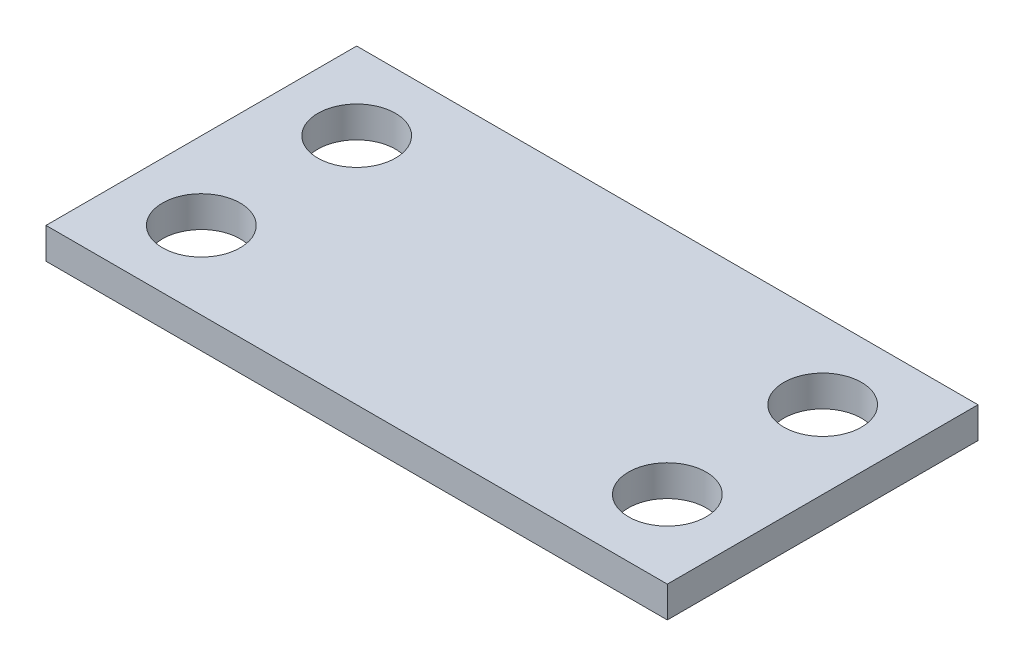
ISO-10303-21;
HEADER;
FILE_DESCRIPTION(('STEP AP214'),'2;1');
FILE_NAME('part.step','',(''),(''),'','','');
FILE_SCHEMA(('AUTOMOTIVE_DESIGN { 1 0 10303 214 1 1 1 1 }'));
ENDSEC;
DATA;
#1=APPLICATION_CONTEXT('core data for automotive mechanical design processes');
#2=APPLICATION_PROTOCOL_DEFINITION('international standard','automotive_design',2000,#1);
#3=PRODUCT_CONTEXT('',#1,'mechanical');
#4=PRODUCT('Part','Part','',(#3));
#5=PRODUCT_RELATED_PRODUCT_CATEGORY('part','',(#4));
#6=PRODUCT_DEFINITION_FORMATION('','',#4);
#7=PRODUCT_DEFINITION_CONTEXT('part definition',#1,'design');
#8=PRODUCT_DEFINITION('design','',#6,#7);
#9=PRODUCT_DEFINITION_SHAPE('','',#8);
#10=(LENGTH_UNIT() NAMED_UNIT(*) SI_UNIT(.MILLI.,.METRE.));
#11=(NAMED_UNIT(*) PLANE_ANGLE_UNIT() SI_UNIT($,.RADIAN.));
#12=(NAMED_UNIT(*) SI_UNIT($,.STERADIAN.) SOLID_ANGLE_UNIT());
#13=UNCERTAINTY_MEASURE_WITH_UNIT(LENGTH_MEASURE(1.E-05),#10,'distance_accuracy_value','');
#14=(GEOMETRIC_REPRESENTATION_CONTEXT(3) GLOBAL_UNCERTAINTY_ASSIGNED_CONTEXT((#13)) GLOBAL_UNIT_ASSIGNED_CONTEXT((#10,
#11,#12)) REPRESENTATION_CONTEXT('',''));
#15=CARTESIAN_POINT('',(0.,0.,0.));
#16=DIRECTION('',(0.,0.,1.));
#17=DIRECTION('',(1.,0.,0.));
#18=AXIS2_PLACEMENT_3D('',#15,#16,#17);
#19=CARTESIAN_POINT('',(40.,4.,-20.));
#20=DIRECTION('',(0.,0.,1.));
#21=DIRECTION('',(1.,0.,0.));
#22=AXIS2_PLACEMENT_3D('',#19,#20,#21);
#23=PLANE('',#22);
#24=DIRECTION('',(-1.,0.,0.));
#25=VECTOR('',#24,1.);
#26=CARTESIAN_POINT('',(40.,0.,-20.));
#27=LINE('',#26,#25);
#28=CARTESIAN_POINT('',(40.,0.,-20.));
#29=VERTEX_POINT('',#28);
#30=CARTESIAN_POINT('',(-40.,0.,-20.));
#31=VERTEX_POINT('',#30);
#32=EDGE_CURVE('E97',#29,#31,#27,.T.);
#33=ORIENTED_EDGE('',*,*,#32,.T.);
#34=DIRECTION('',(0.,-1.,0.));
#35=VECTOR('',#34,1.);
#36=CARTESIAN_POINT('',(-40.,4.,-20.));
#37=LINE('',#36,#35);
#38=CARTESIAN_POINT('',(-40.,4.,-20.));
#39=VERTEX_POINT('',#38);
#40=EDGE_CURVE('E11',#39,#31,#37,.T.);
#41=ORIENTED_EDGE('',*,*,#40,.F.);
#42=DIRECTION('',(-1.,0.,0.));
#43=VECTOR('',#42,1.);
#44=CARTESIAN_POINT('',(40.,4.,-20.));
#45=LINE('',#44,#43);
#46=CARTESIAN_POINT('',(40.,4.,-20.));
#47=VERTEX_POINT('',#46);
#48=EDGE_CURVE('E85',#47,#39,#45,.T.);
#49=ORIENTED_EDGE('',*,*,#48,.F.);
#50=DIRECTION('',(0.,-1.,0.));
#51=VECTOR('',#50,1.);
#52=CARTESIAN_POINT('',(40.,4.,-20.));
#53=LINE('',#52,#51);
#54=EDGE_CURVE('E93',#47,#29,#53,.T.);
#55=ORIENTED_EDGE('',*,*,#54,.T.);
#56=EDGE_LOOP('',(#33,#41,#49,#55));
#57=FACE_BOUND('',#56,.T.);
#58=ADVANCED_FACE('F34',(#57),#23,.F.);
#59=CARTESIAN_POINT('',(-40.,4.,-20.));
#60=DIRECTION('',(1.,0.,0.));
#61=DIRECTION('',(0.,0.,-1.));
#62=AXIS2_PLACEMENT_3D('',#59,#60,#61);
#63=PLANE('',#62);
#64=DIRECTION('',(0.,0.,1.));
#65=VECTOR('',#64,1.);
#66=CARTESIAN_POINT('',(-40.,0.,-20.));
#67=LINE('',#66,#65);
#68=CARTESIAN_POINT('',(-40.,0.,20.));
#69=VERTEX_POINT('',#68);
#70=EDGE_CURVE('E89',#31,#69,#67,.T.);
#71=ORIENTED_EDGE('',*,*,#70,.T.);
#72=DIRECTION('',(0.,-1.,0.));
#73=VECTOR('',#72,1.);
#74=CARTESIAN_POINT('',(-40.,4.,20.));
#75=LINE('',#74,#73);
#76=CARTESIAN_POINT('',(-40.,4.,20.));
#77=VERTEX_POINT('',#76);
#78=EDGE_CURVE('E42',#77,#69,#75,.T.);
#79=ORIENTED_EDGE('',*,*,#78,.F.);
#80=DIRECTION('',(0.,0.,1.));
#81=VECTOR('',#80,1.);
#82=CARTESIAN_POINT('',(-40.,4.,-20.));
#83=LINE('',#82,#81);
#84=EDGE_CURVE('E80',#39,#77,#83,.T.);
#85=ORIENTED_EDGE('',*,*,#84,.F.);
#86=ORIENTED_EDGE('',*,*,#40,.T.);
#87=EDGE_LOOP('',(#71,#79,#85,#86));
#88=FACE_BOUND('',#87,.T.);
#89=ADVANCED_FACE('F88',(#88),#63,.F.);
#90=CARTESIAN_POINT('',(-40.,4.,20.));
#91=DIRECTION('',(0.,0.,-1.));
#92=DIRECTION('',(-1.,0.,0.));
#93=AXIS2_PLACEMENT_3D('',#90,#91,#92);
#94=PLANE('',#93);
#95=DIRECTION('',(1.,0.,0.));
#96=VECTOR('',#95,1.);
#97=CARTESIAN_POINT('',(-40.,0.,20.));
#98=LINE('',#97,#96);
#99=CARTESIAN_POINT('',(40.,0.,20.));
#100=VERTEX_POINT('',#99);
#101=EDGE_CURVE('E67',#69,#100,#98,.T.);
#102=ORIENTED_EDGE('',*,*,#101,.T.);
#103=DIRECTION('',(0.,-1.,0.));
#104=VECTOR('',#103,1.);
#105=CARTESIAN_POINT('',(40.,4.,20.));
#106=LINE('',#105,#104);
#107=CARTESIAN_POINT('',(40.,4.,20.));
#108=VERTEX_POINT('',#107);
#109=EDGE_CURVE('E90',#108,#100,#106,.T.);
#110=ORIENTED_EDGE('',*,*,#109,.F.);
#111=DIRECTION('',(1.,0.,0.));
#112=VECTOR('',#111,1.);
#113=CARTESIAN_POINT('',(-40.,4.,20.));
#114=LINE('',#113,#112);
#115=EDGE_CURVE('E83',#77,#108,#114,.T.);
#116=ORIENTED_EDGE('',*,*,#115,.F.);
#117=ORIENTED_EDGE('',*,*,#78,.T.);
#118=EDGE_LOOP('',(#102,#110,#116,#117));
#119=FACE_BOUND('',#118,.T.);
#120=ADVANCED_FACE('F91',(#119),#94,.F.);
#121=CARTESIAN_POINT('',(40.,4.,20.));
#122=DIRECTION('',(-1.,0.,0.));
#123=DIRECTION('',(0.,0.,1.));
#124=AXIS2_PLACEMENT_3D('',#121,#122,#123);
#125=PLANE('',#124);
#126=DIRECTION('',(0.,0.,-1.));
#127=VECTOR('',#126,1.);
#128=CARTESIAN_POINT('',(40.,0.,20.));
#129=LINE('',#128,#127);
#130=EDGE_CURVE('E73',#100,#29,#129,.T.);
#131=ORIENTED_EDGE('',*,*,#130,.T.);
#132=ORIENTED_EDGE('',*,*,#54,.F.);
#133=DIRECTION('',(0.,0.,-1.));
#134=VECTOR('',#133,1.);
#135=CARTESIAN_POINT('',(40.,4.,20.));
#136=LINE('',#135,#134);
#137=EDGE_CURVE('E50',#108,#47,#136,.T.);
#138=ORIENTED_EDGE('',*,*,#137,.F.);
#139=ORIENTED_EDGE('',*,*,#109,.T.);
#140=EDGE_LOOP('',(#131,#132,#138,#139));
#141=FACE_BOUND('',#140,.T.);
#142=ADVANCED_FACE('F105',(#141),#125,.F.);
#143=CARTESIAN_POINT('',(0.,4.,0.));
#144=DIRECTION('',(0.,1.,0.));
#145=DIRECTION('',(0.,0.,1.));
#146=AXIS2_PLACEMENT_3D('',#143,#144,#145);
#147=PLANE('',#146);
#148=CARTESIAN_POINT('',(30.,4.,-10.));
#149=DIRECTION('',(0.,1.,0.));
#150=DIRECTION('',(0.,0.,1.));
#151=AXIS2_PLACEMENT_3D('',#148,#149,#150);
#152=CIRCLE('',#151,5.);
#153=CARTESIAN_POINT('',(30.,4.,-5.));
#154=VERTEX_POINT('',#153);
#155=EDGE_CURVE('E129',#154,#154,#152,.T.);
#156=ORIENTED_EDGE('',*,*,#155,.F.);
#157=EDGE_LOOP('',(#156));
#158=FACE_BOUND('',#157,.T.);
#159=CARTESIAN_POINT('',(30.,4.,10.));
#160=DIRECTION('',(0.,1.,0.));
#161=DIRECTION('',(0.,0.,1.));
#162=AXIS2_PLACEMENT_3D('',#159,#160,#161);
#163=CIRCLE('',#162,5.);
#164=CARTESIAN_POINT('',(30.,4.,15.));
#165=VERTEX_POINT('',#164);
#166=EDGE_CURVE('E123',#165,#165,#163,.T.);
#167=ORIENTED_EDGE('',*,*,#166,.F.);
#168=EDGE_LOOP('',(#167));
#169=FACE_BOUND('',#168,.T.);
#170=CARTESIAN_POINT('',(-30.,4.,10.));
#171=DIRECTION('',(0.,1.,0.));
#172=DIRECTION('',(0.,0.,1.));
#173=AXIS2_PLACEMENT_3D('',#170,#171,#172);
#174=CIRCLE('',#173,5.);
#175=CARTESIAN_POINT('',(-30.,4.,15.));
#176=VERTEX_POINT('',#175);
#177=EDGE_CURVE('E117',#176,#176,#174,.T.);
#178=ORIENTED_EDGE('',*,*,#177,.F.);
#179=EDGE_LOOP('',(#178));
#180=FACE_BOUND('',#179,.T.);
#181=CARTESIAN_POINT('',(-30.,4.,-10.));
#182=DIRECTION('',(0.,1.,0.));
#183=DIRECTION('',(0.,0.,1.));
#184=AXIS2_PLACEMENT_3D('',#181,#182,#183);
#185=CIRCLE('',#184,5.);
#186=CARTESIAN_POINT('',(-30.,4.,-5.));
#187=VERTEX_POINT('',#186);
#188=EDGE_CURVE('E111',#187,#187,#185,.T.);
#189=ORIENTED_EDGE('',*,*,#188,.F.);
#190=EDGE_LOOP('',(#189));
#191=FACE_BOUND('',#190,.T.);
#192=ORIENTED_EDGE('',*,*,#48,.T.);
#193=ORIENTED_EDGE('',*,*,#84,.T.);
#194=ORIENTED_EDGE('',*,*,#115,.T.);
#195=ORIENTED_EDGE('',*,*,#137,.T.);
#196=EDGE_LOOP('',(#192,#193,#194,#195));
#197=FACE_BOUND('',#196,.T.);
#198=ADVANCED_FACE('F81',(#158,#169,#180,#191,#197),#147,.T.);
#199=CARTESIAN_POINT('',(0.,0.,0.));
#200=DIRECTION('',(0.,1.,0.));
#201=DIRECTION('',(0.,0.,1.));
#202=AXIS2_PLACEMENT_3D('',#199,#200,#201);
#203=PLANE('',#202);
#204=CARTESIAN_POINT('',(30.,0.,-10.));
#205=DIRECTION('',(0.,1.,0.));
#206=DIRECTION('',(0.,0.,1.));
#207=AXIS2_PLACEMENT_3D('',#204,#205,#206);
#208=CIRCLE('',#207,5.);
#209=CARTESIAN_POINT('',(30.,0.,-5.));
#210=VERTEX_POINT('',#209);
#211=EDGE_CURVE('E126',#210,#210,#208,.T.);
#212=ORIENTED_EDGE('',*,*,#211,.T.);
#213=EDGE_LOOP('',(#212));
#214=FACE_BOUND('',#213,.T.);
#215=CARTESIAN_POINT('',(30.,0.,10.));
#216=DIRECTION('',(0.,1.,0.));
#217=DIRECTION('',(0.,0.,1.));
#218=AXIS2_PLACEMENT_3D('',#215,#216,#217);
#219=CIRCLE('',#218,5.);
#220=CARTESIAN_POINT('',(30.,0.,15.));
#221=VERTEX_POINT('',#220);
#222=EDGE_CURVE('E120',#221,#221,#219,.T.);
#223=ORIENTED_EDGE('',*,*,#222,.T.);
#224=EDGE_LOOP('',(#223));
#225=FACE_BOUND('',#224,.T.);
#226=CARTESIAN_POINT('',(-30.,0.,10.));
#227=DIRECTION('',(0.,1.,0.));
#228=DIRECTION('',(0.,0.,1.));
#229=AXIS2_PLACEMENT_3D('',#226,#227,#228);
#230=CIRCLE('',#229,5.);
#231=CARTESIAN_POINT('',(-30.,0.,15.));
#232=VERTEX_POINT('',#231);
#233=EDGE_CURVE('E114',#232,#232,#230,.T.);
#234=ORIENTED_EDGE('',*,*,#233,.T.);
#235=EDGE_LOOP('',(#234));
#236=FACE_BOUND('',#235,.T.);
#237=CARTESIAN_POINT('',(-30.,0.,-10.));
#238=DIRECTION('',(0.,1.,0.));
#239=DIRECTION('',(0.,0.,1.));
#240=AXIS2_PLACEMENT_3D('',#237,#238,#239);
#241=CIRCLE('',#240,5.);
#242=CARTESIAN_POINT('',(-30.,0.,-5.));
#243=VERTEX_POINT('',#242);
#244=EDGE_CURVE('E100',#243,#243,#241,.T.);
#245=ORIENTED_EDGE('',*,*,#244,.T.);
#246=EDGE_LOOP('',(#245));
#247=FACE_BOUND('',#246,.T.);
#248=ORIENTED_EDGE('',*,*,#32,.F.);
#249=ORIENTED_EDGE('',*,*,#130,.F.);
#250=ORIENTED_EDGE('',*,*,#101,.F.);
#251=ORIENTED_EDGE('',*,*,#70,.F.);
#252=EDGE_LOOP('',(#248,#249,#250,#251));
#253=FACE_BOUND('',#252,.T.);
#254=ADVANCED_FACE('F108',(#214,#225,#236,#247,#253),#203,.F.);
#255=CARTESIAN_POINT('',(-30.,0.,-10.));
#256=DIRECTION('',(0.,1.,0.));
#257=DIRECTION('',(0.,0.,1.));
#258=AXIS2_PLACEMENT_3D('',#255,#256,#257);
#259=CYLINDRICAL_SURFACE('',#258,5.);
#260=ORIENTED_EDGE('',*,*,#244,.F.);
#261=EDGE_LOOP('',(#260));
#262=FACE_BOUND('',#261,.T.);
#263=ORIENTED_EDGE('',*,*,#188,.T.);
#264=EDGE_LOOP('',(#263));
#265=FACE_BOUND('',#264,.T.);
#266=ADVANCED_FACE('F153',(#262,#265),#259,.F.);
#267=CARTESIAN_POINT('',(-30.,0.,10.));
#268=DIRECTION('',(0.,1.,0.));
#269=DIRECTION('',(0.,0.,1.));
#270=AXIS2_PLACEMENT_3D('',#267,#268,#269);
#271=CYLINDRICAL_SURFACE('',#270,5.);
#272=ORIENTED_EDGE('',*,*,#233,.F.);
#273=EDGE_LOOP('',(#272));
#274=FACE_BOUND('',#273,.T.);
#275=ORIENTED_EDGE('',*,*,#177,.T.);
#276=EDGE_LOOP('',(#275));
#277=FACE_BOUND('',#276,.T.);
#278=ADVANCED_FACE('F155',(#274,#277),#271,.F.);
#279=CARTESIAN_POINT('',(30.,0.,10.));
#280=DIRECTION('',(0.,1.,0.));
#281=DIRECTION('',(0.,0.,1.));
#282=AXIS2_PLACEMENT_3D('',#279,#280,#281);
#283=CYLINDRICAL_SURFACE('',#282,5.);
#284=ORIENTED_EDGE('',*,*,#222,.F.);
#285=EDGE_LOOP('',(#284));
#286=FACE_BOUND('',#285,.T.);
#287=ORIENTED_EDGE('',*,*,#166,.T.);
#288=EDGE_LOOP('',(#287));
#289=FACE_BOUND('',#288,.T.);
#290=ADVANCED_FACE('F140',(#286,#289),#283,.F.);
#291=CARTESIAN_POINT('',(30.,0.,-10.));
#292=DIRECTION('',(0.,1.,0.));
#293=DIRECTION('',(0.,0.,1.));
#294=AXIS2_PLACEMENT_3D('',#291,#292,#293);
#295=CYLINDRICAL_SURFACE('',#294,5.);
#296=ORIENTED_EDGE('',*,*,#211,.F.);
#297=EDGE_LOOP('',(#296));
#298=FACE_BOUND('',#297,.T.);
#299=ORIENTED_EDGE('',*,*,#155,.T.);
#300=EDGE_LOOP('',(#299));
#301=FACE_BOUND('',#300,.T.);
#302=ADVANCED_FACE('F137',(#298,#301),#295,.F.);
#303=CLOSED_SHELL('',(#58,#89,#120,#142,#198,#254,#266,#278,#290,#302));
#304=MANIFOLD_SOLID_BREP('B2',#303);
#305=ADVANCED_BREP_SHAPE_REPRESENTATION('',(#18,#304),#14);
#306=SHAPE_DEFINITION_REPRESENTATION(#9,#305);
ENDSEC;
END-ISO-10303-21;
